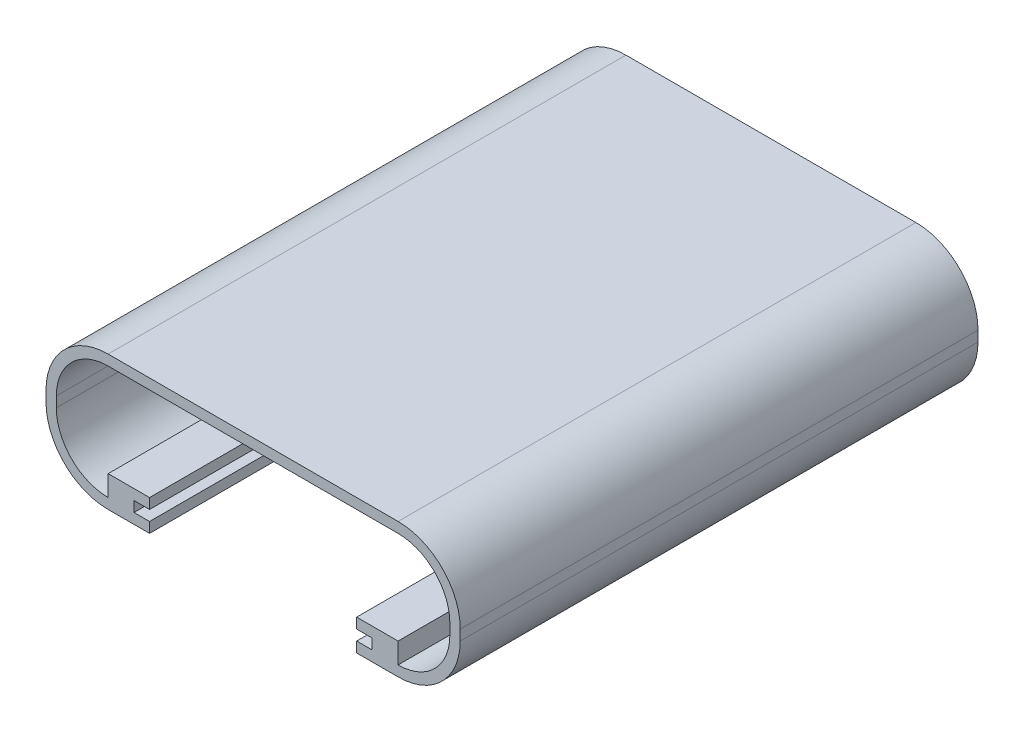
ISO-10303-21;
HEADER;
FILE_DESCRIPTION(('STEP AP214'),'2;1');
FILE_NAME('part.step','',(''),(''),'','','');
FILE_SCHEMA(('AUTOMOTIVE_DESIGN { 1 0 10303 214 1 1 1 1 }'));
ENDSEC;
DATA;
#1=APPLICATION_CONTEXT('core data for automotive mechanical design processes');
#2=APPLICATION_PROTOCOL_DEFINITION('international standard','automotive_design',2000,#1);
#3=PRODUCT_CONTEXT('',#1,'mechanical');
#4=PRODUCT('Part','Part','',(#3));
#5=PRODUCT_RELATED_PRODUCT_CATEGORY('part','',(#4));
#6=PRODUCT_DEFINITION_FORMATION('','',#4);
#7=PRODUCT_DEFINITION_CONTEXT('part definition',#1,'design');
#8=PRODUCT_DEFINITION('design','',#6,#7);
#9=PRODUCT_DEFINITION_SHAPE('','',#8);
#10=(LENGTH_UNIT() NAMED_UNIT(*) SI_UNIT(.MILLI.,.METRE.));
#11=(NAMED_UNIT(*) PLANE_ANGLE_UNIT() SI_UNIT($,.RADIAN.));
#12=(NAMED_UNIT(*) SI_UNIT($,.STERADIAN.) SOLID_ANGLE_UNIT());
#13=UNCERTAINTY_MEASURE_WITH_UNIT(LENGTH_MEASURE(1.E-05),#10,'distance_accuracy_value','');
#14=(GEOMETRIC_REPRESENTATION_CONTEXT(3) GLOBAL_UNCERTAINTY_ASSIGNED_CONTEXT((#13)) GLOBAL_UNIT_ASSIGNED_CONTEXT((#10,
#11,#12)) REPRESENTATION_CONTEXT('',''));
#15=CARTESIAN_POINT('',(0.,0.,0.));
#16=DIRECTION('',(0.,0.,1.));
#17=DIRECTION('',(1.,0.,0.));
#18=AXIS2_PLACEMENT_3D('',#15,#16,#17);
#19=CARTESIAN_POINT('',(-23.8160338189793,5.,50.));
#20=DIRECTION('',(0.,0.,-1.));
#21=DIRECTION('',(-1.,0.,0.));
#22=AXIS2_PLACEMENT_3D('',#19,#20,#21);
#23=CYLINDRICAL_SURFACE('',#22,5.);
#24=CARTESIAN_POINT('',(-23.8160338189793,5.,0.));
#25=DIRECTION('',(0.,0.,-1.));
#26=DIRECTION('',(-1.,0.,0.));
#27=AXIS2_PLACEMENT_3D('',#24,#25,#26);
#28=CIRCLE('',#27,5.);
#29=CARTESIAN_POINT('',(-23.8160338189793,0.,0.));
#30=VERTEX_POINT('',#29);
#31=CARTESIAN_POINT('',(-28.8160338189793,5.,0.));
#32=VERTEX_POINT('',#31);
#33=EDGE_CURVE('E261',#30,#32,#28,.T.);
#34=ORIENTED_EDGE('',*,*,#33,.T.);
#35=DIRECTION('',(0.,0.,-1.));
#36=VECTOR('',#35,1.);
#37=CARTESIAN_POINT('',(-28.8160338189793,5.,50.));
#38=LINE('',#37,#36);
#39=CARTESIAN_POINT('',(-28.8160338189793,5.,50.));
#40=VERTEX_POINT('',#39);
#41=EDGE_CURVE('E11',#40,#32,#38,.T.);
#42=ORIENTED_EDGE('',*,*,#41,.F.);
#43=CARTESIAN_POINT('',(-23.8160338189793,5.,50.));
#44=DIRECTION('',(0.,0.,-1.));
#45=DIRECTION('',(-1.,0.,0.));
#46=AXIS2_PLACEMENT_3D('',#43,#44,#45);
#47=CIRCLE('',#46,5.);
#48=CARTESIAN_POINT('',(-23.8160338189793,0.,50.));
#49=VERTEX_POINT('',#48);
#50=EDGE_CURVE('E319',#49,#40,#47,.T.);
#51=ORIENTED_EDGE('',*,*,#50,.F.);
#52=DIRECTION('',(0.,0.,-1.));
#53=VECTOR('',#52,1.);
#54=CARTESIAN_POINT('',(-23.8160338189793,0.,50.));
#55=LINE('',#54,#53);
#56=EDGE_CURVE('E257',#49,#30,#55,.T.);
#57=ORIENTED_EDGE('',*,*,#56,.T.);
#58=EDGE_LOOP('',(#34,#42,#51,#57));
#59=FACE_BOUND('',#58,.T.);
#60=ADVANCED_FACE('F33',(#59),#23,.F.);
#61=CARTESIAN_POINT('',(-28.8160338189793,5.,50.));
#62=DIRECTION('',(-1.,0.,0.));
#63=DIRECTION('',(0.,0.,1.));
#64=AXIS2_PLACEMENT_3D('',#61,#62,#63);
#65=PLANE('',#64);
#66=DIRECTION('',(0.,1.,0.));
#67=VECTOR('',#66,1.);
#68=CARTESIAN_POINT('',(-28.8160338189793,5.,0.));
#69=LINE('',#68,#67);
#70=CARTESIAN_POINT('',(-28.8160338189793,6.,0.));
#71=VERTEX_POINT('',#70);
#72=EDGE_CURVE('E264',#32,#71,#69,.T.);
#73=ORIENTED_EDGE('',*,*,#72,.T.);
#74=DIRECTION('',(0.,0.,-1.));
#75=VECTOR('',#74,1.);
#76=CARTESIAN_POINT('',(-28.8160338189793,6.,50.));
#77=LINE('',#76,#75);
#78=CARTESIAN_POINT('',(-28.8160338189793,6.,50.));
#79=VERTEX_POINT('',#78);
#80=EDGE_CURVE('E41',#79,#71,#77,.T.);
#81=ORIENTED_EDGE('',*,*,#80,.F.);
#82=DIRECTION('',(0.,1.,0.));
#83=VECTOR('',#82,1.);
#84=CARTESIAN_POINT('',(-28.8160338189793,5.,50.));
#85=LINE('',#84,#83);
#86=EDGE_CURVE('E158',#40,#79,#85,.T.);
#87=ORIENTED_EDGE('',*,*,#86,.F.);
#88=ORIENTED_EDGE('',*,*,#41,.T.);
#89=EDGE_LOOP('',(#73,#81,#87,#88));
#90=FACE_BOUND('',#89,.T.);
#91=ADVANCED_FACE('F487',(#90),#65,.F.);
#92=CARTESIAN_POINT('',(-23.8160338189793,6.,50.));
#93=DIRECTION('',(0.,0.,-1.));
#94=DIRECTION('',(-1.,0.,0.));
#95=AXIS2_PLACEMENT_3D('',#92,#93,#94);
#96=CYLINDRICAL_SURFACE('',#95,5.);
#97=CARTESIAN_POINT('',(-23.8160338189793,6.,0.));
#98=DIRECTION('',(0.,0.,-1.));
#99=DIRECTION('',(-1.,0.,0.));
#100=AXIS2_PLACEMENT_3D('',#97,#98,#99);
#101=CIRCLE('',#100,5.);
#102=CARTESIAN_POINT('',(-23.8160338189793,11.,0.));
#103=VERTEX_POINT('',#102);
#104=EDGE_CURVE('E266',#71,#103,#101,.T.);
#105=ORIENTED_EDGE('',*,*,#104,.T.);
#106=DIRECTION('',(0.,0.,-1.));
#107=VECTOR('',#106,1.);
#108=CARTESIAN_POINT('',(-23.8160338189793,11.,50.));
#109=LINE('',#108,#107);
#110=CARTESIAN_POINT('',(-23.8160338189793,11.,50.));
#111=VERTEX_POINT('',#110);
#112=EDGE_CURVE('E392',#111,#103,#109,.T.);
#113=ORIENTED_EDGE('',*,*,#112,.F.);
#114=CARTESIAN_POINT('',(-23.8160338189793,6.,50.));
#115=DIRECTION('',(0.,0.,-1.));
#116=DIRECTION('',(-1.,0.,0.));
#117=AXIS2_PLACEMENT_3D('',#114,#115,#116);
#118=CIRCLE('',#117,5.);
#119=EDGE_CURVE('E400',#79,#111,#118,.T.);
#120=ORIENTED_EDGE('',*,*,#119,.F.);
#121=ORIENTED_EDGE('',*,*,#80,.T.);
#122=EDGE_LOOP('',(#105,#113,#120,#121));
#123=FACE_BOUND('',#122,.T.);
#124=ADVANCED_FACE('F398',(#123),#96,.F.);
#125=CARTESIAN_POINT('',(-23.8160338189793,11.,50.));
#126=DIRECTION('',(0.,1.,0.));
#127=DIRECTION('',(-1.,0.,0.));
#128=AXIS2_PLACEMENT_3D('',#125,#126,#127);
#129=PLANE('',#128);
#130=DIRECTION('',(1.,0.,0.));
#131=VECTOR('',#130,1.);
#132=CARTESIAN_POINT('',(-23.8160338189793,11.,0.));
#133=LINE('',#132,#131);
#134=CARTESIAN_POINT('',(4.18396618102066,11.,0.));
#135=VERTEX_POINT('',#134);
#136=EDGE_CURVE('E268',#103,#135,#133,.T.);
#137=ORIENTED_EDGE('',*,*,#136,.T.);
#138=DIRECTION('',(0.,0.,-1.));
#139=VECTOR('',#138,1.);
#140=CARTESIAN_POINT('',(4.18396618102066,11.,50.));
#141=LINE('',#140,#139);
#142=CARTESIAN_POINT('',(4.18396618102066,11.,50.));
#143=VERTEX_POINT('',#142);
#144=EDGE_CURVE('E389',#143,#135,#141,.T.);
#145=ORIENTED_EDGE('',*,*,#144,.F.);
#146=DIRECTION('',(1.,0.,0.));
#147=VECTOR('',#146,1.);
#148=CARTESIAN_POINT('',(-23.8160338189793,11.,50.));
#149=LINE('',#148,#147);
#150=EDGE_CURVE('E418',#111,#143,#149,.T.);
#151=ORIENTED_EDGE('',*,*,#150,.F.);
#152=ORIENTED_EDGE('',*,*,#112,.T.);
#153=EDGE_LOOP('',(#137,#145,#151,#152));
#154=FACE_BOUND('',#153,.T.);
#155=ADVANCED_FACE('F409',(#154),#129,.F.);
#156=CARTESIAN_POINT('',(4.18396618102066,6.,50.));
#157=DIRECTION('',(0.,0.,-1.));
#158=DIRECTION('',(-1.,0.,0.));
#159=AXIS2_PLACEMENT_3D('',#156,#157,#158);
#160=CYLINDRICAL_SURFACE('',#159,5.);
#161=CARTESIAN_POINT('',(4.18396618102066,6.,0.));
#162=DIRECTION('',(0.,0.,-1.));
#163=DIRECTION('',(1.,0.,0.));
#164=AXIS2_PLACEMENT_3D('',#161,#162,#163);
#165=CIRCLE('',#164,5.);
#166=CARTESIAN_POINT('',(9.18396618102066,6.,0.));
#167=VERTEX_POINT('',#166);
#168=EDGE_CURVE('E270',#135,#167,#165,.T.);
#169=ORIENTED_EDGE('',*,*,#168,.T.);
#170=DIRECTION('',(0.,0.,-1.));
#171=VECTOR('',#170,1.);
#172=CARTESIAN_POINT('',(9.18396618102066,6.,50.));
#173=LINE('',#172,#171);
#174=CARTESIAN_POINT('',(9.18396618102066,6.,50.));
#175=VERTEX_POINT('',#174);
#176=EDGE_CURVE('E386',#175,#167,#173,.T.);
#177=ORIENTED_EDGE('',*,*,#176,.F.);
#178=CARTESIAN_POINT('',(4.18396618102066,6.,50.));
#179=DIRECTION('',(0.,0.,-1.));
#180=DIRECTION('',(1.,0.,0.));
#181=AXIS2_PLACEMENT_3D('',#178,#179,#180);
#182=CIRCLE('',#181,5.);
#183=EDGE_CURVE('E415',#143,#175,#182,.T.);
#184=ORIENTED_EDGE('',*,*,#183,.F.);
#185=ORIENTED_EDGE('',*,*,#144,.T.);
#186=EDGE_LOOP('',(#169,#177,#184,#185));
#187=FACE_BOUND('',#186,.T.);
#188=ADVANCED_FACE('F413',(#187),#160,.F.);
#189=CARTESIAN_POINT('',(9.18396618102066,5.,50.));
#190=DIRECTION('',(1.,0.,0.));
#191=DIRECTION('',(0.,0.,-1.));
#192=AXIS2_PLACEMENT_3D('',#189,#190,#191);
#193=PLANE('',#192);
#194=DIRECTION('',(0.,-1.,0.));
#195=VECTOR('',#194,1.);
#196=CARTESIAN_POINT('',(9.18396618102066,5.,0.));
#197=LINE('',#196,#195);
#198=CARTESIAN_POINT('',(9.18396618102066,5.,0.));
#199=VERTEX_POINT('',#198);
#200=EDGE_CURVE('E272',#167,#199,#197,.T.);
#201=ORIENTED_EDGE('',*,*,#200,.T.);
#202=DIRECTION('',(0.,0.,-1.));
#203=VECTOR('',#202,1.);
#204=CARTESIAN_POINT('',(9.18396618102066,5.,50.));
#205=LINE('',#204,#203);
#206=CARTESIAN_POINT('',(9.18396618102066,5.,50.));
#207=VERTEX_POINT('',#206);
#208=EDGE_CURVE('E383',#207,#199,#205,.T.);
#209=ORIENTED_EDGE('',*,*,#208,.F.);
#210=DIRECTION('',(0.,-1.,0.));
#211=VECTOR('',#210,1.);
#212=CARTESIAN_POINT('',(9.18396618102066,5.,50.));
#213=LINE('',#212,#211);
#214=EDGE_CURVE('E417',#175,#207,#213,.T.);
#215=ORIENTED_EDGE('',*,*,#214,.F.);
#216=ORIENTED_EDGE('',*,*,#176,.T.);
#217=EDGE_LOOP('',(#201,#209,#215,#216));
#218=FACE_BOUND('',#217,.T.);
#219=ADVANCED_FACE('F500',(#218),#193,.F.);
#220=CARTESIAN_POINT('',(4.18396618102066,5.,50.));
#221=DIRECTION('',(0.,0.,-1.));
#222=DIRECTION('',(-1.,0.,0.));
#223=AXIS2_PLACEMENT_3D('',#220,#221,#222);
#224=CYLINDRICAL_SURFACE('',#223,5.);
#225=CARTESIAN_POINT('',(4.18396618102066,5.,0.));
#226=DIRECTION('',(0.,0.,-1.));
#227=DIRECTION('',(1.,0.,0.));
#228=AXIS2_PLACEMENT_3D('',#225,#226,#227);
#229=CIRCLE('',#228,5.);
#230=CARTESIAN_POINT('',(4.18396618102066,0.,0.));
#231=VERTEX_POINT('',#230);
#232=EDGE_CURVE('E274',#199,#231,#229,.T.);
#233=ORIENTED_EDGE('',*,*,#232,.T.);
#234=DIRECTION('',(0.,0.,-1.));
#235=VECTOR('',#234,1.);
#236=CARTESIAN_POINT('',(4.18396618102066,0.,50.));
#237=LINE('',#236,#235);
#238=CARTESIAN_POINT('',(4.18396618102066,0.,50.));
#239=VERTEX_POINT('',#238);
#240=EDGE_CURVE('E380',#239,#231,#237,.T.);
#241=ORIENTED_EDGE('',*,*,#240,.F.);
#242=CARTESIAN_POINT('',(4.18396618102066,5.,50.));
#243=DIRECTION('',(0.,0.,-1.));
#244=DIRECTION('',(1.,0.,0.));
#245=AXIS2_PLACEMENT_3D('',#242,#243,#244);
#246=CIRCLE('',#245,5.);
#247=EDGE_CURVE('E420',#207,#239,#246,.T.);
#248=ORIENTED_EDGE('',*,*,#247,.F.);
#249=ORIENTED_EDGE('',*,*,#208,.T.);
#250=EDGE_LOOP('',(#233,#241,#248,#249));
#251=FACE_BOUND('',#250,.T.);
#252=ADVANCED_FACE('F503',(#251),#224,.F.);
#253=CARTESIAN_POINT('',(4.18396618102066,0.,50.));
#254=DIRECTION('',(-1.,0.,0.));
#255=DIRECTION('',(0.,0.,1.));
#256=AXIS2_PLACEMENT_3D('',#253,#254,#255);
#257=PLANE('',#256);
#258=DIRECTION('',(0.,1.,0.));
#259=VECTOR('',#258,1.);
#260=CARTESIAN_POINT('',(4.18396618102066,0.,0.));
#261=LINE('',#260,#259);
#262=CARTESIAN_POINT('',(4.18396618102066,2.,0.));
#263=VERTEX_POINT('',#262);
#264=EDGE_CURVE('E276',#231,#263,#261,.T.);
#265=ORIENTED_EDGE('',*,*,#264,.T.);
#266=DIRECTION('',(0.,0.,-1.));
#267=VECTOR('',#266,1.);
#268=CARTESIAN_POINT('',(4.18396618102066,2.,50.));
#269=LINE('',#268,#267);
#270=CARTESIAN_POINT('',(4.18396618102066,2.,50.));
#271=VERTEX_POINT('',#270);
#272=EDGE_CURVE('E377',#271,#263,#269,.T.);
#273=ORIENTED_EDGE('',*,*,#272,.F.);
#274=DIRECTION('',(0.,1.,0.));
#275=VECTOR('',#274,1.);
#276=CARTESIAN_POINT('',(4.18396618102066,0.,50.));
#277=LINE('',#276,#275);
#278=EDGE_CURVE('E426',#239,#271,#277,.T.);
#279=ORIENTED_EDGE('',*,*,#278,.F.);
#280=ORIENTED_EDGE('',*,*,#240,.T.);
#281=EDGE_LOOP('',(#265,#273,#279,#280));
#282=FACE_BOUND('',#281,.T.);
#283=ADVANCED_FACE('F507',(#282),#257,.F.);
#284=CARTESIAN_POINT('',(4.18396618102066,2.,50.));
#285=DIRECTION('',(0.,-1.,0.));
#286=DIRECTION('',(0.,0.,-1.));
#287=AXIS2_PLACEMENT_3D('',#284,#285,#286);
#288=PLANE('',#287);
#289=DIRECTION('',(-1.,0.,0.));
#290=VECTOR('',#289,1.);
#291=CARTESIAN_POINT('',(4.18396618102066,2.,0.));
#292=LINE('',#291,#290);
#293=CARTESIAN_POINT('',(0.183966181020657,2.,0.));
#294=VERTEX_POINT('',#293);
#295=EDGE_CURVE('E278',#263,#294,#292,.T.);
#296=ORIENTED_EDGE('',*,*,#295,.T.);
#297=DIRECTION('',(0.,0.,-1.));
#298=VECTOR('',#297,1.);
#299=CARTESIAN_POINT('',(0.183966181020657,2.,50.));
#300=LINE('',#299,#298);
#301=CARTESIAN_POINT('',(0.183966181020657,2.,50.));
#302=VERTEX_POINT('',#301);
#303=EDGE_CURVE('E374',#302,#294,#300,.T.);
#304=ORIENTED_EDGE('',*,*,#303,.F.);
#305=DIRECTION('',(-1.,0.,0.));
#306=VECTOR('',#305,1.);
#307=CARTESIAN_POINT('',(4.18396618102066,2.,50.));
#308=LINE('',#307,#306);
#309=EDGE_CURVE('E428',#271,#302,#308,.T.);
#310=ORIENTED_EDGE('',*,*,#309,.F.);
#311=ORIENTED_EDGE('',*,*,#272,.T.);
#312=EDGE_LOOP('',(#296,#304,#310,#311));
#313=FACE_BOUND('',#312,.T.);
#314=ADVANCED_FACE('F511',(#313),#288,.F.);
#315=CARTESIAN_POINT('',(0.183966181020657,2.,50.));
#316=DIRECTION('',(1.,0.,0.));
#317=DIRECTION('',(0.,0.,-1.));
#318=AXIS2_PLACEMENT_3D('',#315,#316,#317);
#319=PLANE('',#318);
#320=DIRECTION('',(0.,-1.,0.));
#321=VECTOR('',#320,1.);
#322=CARTESIAN_POINT('',(0.183966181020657,2.,0.));
#323=LINE('',#322,#321);
#324=CARTESIAN_POINT('',(0.183966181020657,1.,0.));
#325=VERTEX_POINT('',#324);
#326=EDGE_CURVE('E280',#294,#325,#323,.T.);
#327=ORIENTED_EDGE('',*,*,#326,.T.);
#328=DIRECTION('',(0.,0.,-1.));
#329=VECTOR('',#328,1.);
#330=CARTESIAN_POINT('',(0.183966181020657,1.,50.));
#331=LINE('',#330,#329);
#332=CARTESIAN_POINT('',(0.183966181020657,1.,50.));
#333=VERTEX_POINT('',#332);
#334=EDGE_CURVE('E371',#333,#325,#331,.T.);
#335=ORIENTED_EDGE('',*,*,#334,.F.);
#336=DIRECTION('',(0.,-1.,0.));
#337=VECTOR('',#336,1.);
#338=CARTESIAN_POINT('',(0.183966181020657,2.,50.));
#339=LINE('',#338,#337);
#340=EDGE_CURVE('E430',#302,#333,#339,.T.);
#341=ORIENTED_EDGE('',*,*,#340,.F.);
#342=ORIENTED_EDGE('',*,*,#303,.T.);
#343=EDGE_LOOP('',(#327,#335,#341,#342));
#344=FACE_BOUND('',#343,.T.);
#345=ADVANCED_FACE('F515',(#344),#319,.F.);
#346=CARTESIAN_POINT('',(0.183966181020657,1.,50.));
#347=DIRECTION('',(0.,1.,0.));
#348=DIRECTION('',(0.,0.,1.));
#349=AXIS2_PLACEMENT_3D('',#346,#347,#348);
#350=PLANE('',#349);
#351=DIRECTION('',(1.,0.,0.));
#352=VECTOR('',#351,1.);
#353=CARTESIAN_POINT('',(0.183966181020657,1.,0.));
#354=LINE('',#353,#352);
#355=CARTESIAN_POINT('',(1.68396618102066,1.,0.));
#356=VERTEX_POINT('',#355);
#357=EDGE_CURVE('E282',#325,#356,#354,.T.);
#358=ORIENTED_EDGE('',*,*,#357,.T.);
#359=DIRECTION('',(0.,0.,-1.));
#360=VECTOR('',#359,1.);
#361=CARTESIAN_POINT('',(1.68396618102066,1.,50.));
#362=LINE('',#361,#360);
#363=CARTESIAN_POINT('',(1.68396618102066,1.,50.));
#364=VERTEX_POINT('',#363);
#365=EDGE_CURVE('E368',#364,#356,#362,.T.);
#366=ORIENTED_EDGE('',*,*,#365,.F.);
#367=DIRECTION('',(1.,0.,0.));
#368=VECTOR('',#367,1.);
#369=CARTESIAN_POINT('',(0.183966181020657,1.,50.));
#370=LINE('',#369,#368);
#371=EDGE_CURVE('E432',#333,#364,#370,.T.);
#372=ORIENTED_EDGE('',*,*,#371,.F.);
#373=ORIENTED_EDGE('',*,*,#334,.T.);
#374=EDGE_LOOP('',(#358,#366,#372,#373));
#375=FACE_BOUND('',#374,.T.);
#376=ADVANCED_FACE('F519',(#375),#350,.F.);
#377=CARTESIAN_POINT('',(1.68396618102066,1.,50.));
#378=DIRECTION('',(1.,0.,0.));
#379=DIRECTION('',(0.,1.,0.));
#380=AXIS2_PLACEMENT_3D('',#377,#378,#379);
#381=PLANE('',#380);
#382=DIRECTION('',(0.,-1.,0.));
#383=VECTOR('',#382,1.);
#384=CARTESIAN_POINT('',(1.68396618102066,1.,0.));
#385=LINE('',#384,#383);
#386=CARTESIAN_POINT('',(1.68396618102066,0.,0.));
#387=VERTEX_POINT('',#386);
#388=EDGE_CURVE('E284',#356,#387,#385,.T.);
#389=ORIENTED_EDGE('',*,*,#388,.T.);
#390=DIRECTION('',(0.,0.,-1.));
#391=VECTOR('',#390,1.);
#392=CARTESIAN_POINT('',(1.68396618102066,0.,50.));
#393=LINE('',#392,#391);
#394=CARTESIAN_POINT('',(1.68396618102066,0.,50.));
#395=VERTEX_POINT('',#394);
#396=EDGE_CURVE('E365',#395,#387,#393,.T.);
#397=ORIENTED_EDGE('',*,*,#396,.F.);
#398=DIRECTION('',(0.,-1.,0.));
#399=VECTOR('',#398,1.);
#400=CARTESIAN_POINT('',(1.68396618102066,1.,50.));
#401=LINE('',#400,#399);
#402=EDGE_CURVE('E434',#364,#395,#401,.T.);
#403=ORIENTED_EDGE('',*,*,#402,.F.);
#404=ORIENTED_EDGE('',*,*,#365,.T.);
#405=EDGE_LOOP('',(#389,#397,#403,#404));
#406=FACE_BOUND('',#405,.T.);
#407=ADVANCED_FACE('F523',(#406),#381,.F.);
#408=CARTESIAN_POINT('',(1.68396618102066,0.,50.));
#409=DIRECTION('',(0.,-1.,0.));
#410=DIRECTION('',(1.,0.,0.));
#411=AXIS2_PLACEMENT_3D('',#408,#409,#410);
#412=PLANE('',#411);
#413=DIRECTION('',(-1.,0.,0.));
#414=VECTOR('',#413,1.);
#415=CARTESIAN_POINT('',(1.68396618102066,0.,0.));
#416=LINE('',#415,#414);
#417=CARTESIAN_POINT('',(0.183966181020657,0.,0.));
#418=VERTEX_POINT('',#417);
#419=EDGE_CURVE('E286',#387,#418,#416,.T.);
#420=ORIENTED_EDGE('',*,*,#419,.T.);
#421=DIRECTION('',(0.,0.,-1.));
#422=VECTOR('',#421,1.);
#423=CARTESIAN_POINT('',(0.183966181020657,0.,50.));
#424=LINE('',#423,#422);
#425=CARTESIAN_POINT('',(0.183966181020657,0.,50.));
#426=VERTEX_POINT('',#425);
#427=EDGE_CURVE('E362',#426,#418,#424,.T.);
#428=ORIENTED_EDGE('',*,*,#427,.F.);
#429=DIRECTION('',(-1.,0.,0.));
#430=VECTOR('',#429,1.);
#431=CARTESIAN_POINT('',(1.68396618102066,0.,50.));
#432=LINE('',#431,#430);
#433=EDGE_CURVE('E436',#395,#426,#432,.T.);
#434=ORIENTED_EDGE('',*,*,#433,.F.);
#435=ORIENTED_EDGE('',*,*,#396,.T.);
#436=EDGE_LOOP('',(#420,#428,#434,#435));
#437=FACE_BOUND('',#436,.T.);
#438=ADVANCED_FACE('F527',(#437),#412,.F.);
#439=CARTESIAN_POINT('',(0.183966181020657,0.,50.));
#440=DIRECTION('',(1.,0.,0.));
#441=DIRECTION('',(0.,0.,-1.));
#442=AXIS2_PLACEMENT_3D('',#439,#440,#441);
#443=PLANE('',#442);
#444=DIRECTION('',(0.,-1.,0.));
#445=VECTOR('',#444,1.);
#446=CARTESIAN_POINT('',(0.183966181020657,0.,0.));
#447=LINE('',#446,#445);
#448=CARTESIAN_POINT('',(0.183966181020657,-1.,0.));
#449=VERTEX_POINT('',#448);
#450=EDGE_CURVE('E288',#418,#449,#447,.T.);
#451=ORIENTED_EDGE('',*,*,#450,.T.);
#452=DIRECTION('',(0.,0.,-1.));
#453=VECTOR('',#452,1.);
#454=CARTESIAN_POINT('',(0.183966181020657,-1.,50.));
#455=LINE('',#454,#453);
#456=CARTESIAN_POINT('',(0.183966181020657,-1.,50.));
#457=VERTEX_POINT('',#456);
#458=EDGE_CURVE('E359',#457,#449,#455,.T.);
#459=ORIENTED_EDGE('',*,*,#458,.F.);
#460=DIRECTION('',(0.,-1.,0.));
#461=VECTOR('',#460,1.);
#462=CARTESIAN_POINT('',(0.183966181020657,0.,50.));
#463=LINE('',#462,#461);
#464=EDGE_CURVE('E438',#426,#457,#463,.T.);
#465=ORIENTED_EDGE('',*,*,#464,.F.);
#466=ORIENTED_EDGE('',*,*,#427,.T.);
#467=EDGE_LOOP('',(#451,#459,#465,#466));
#468=FACE_BOUND('',#467,.T.);
#469=ADVANCED_FACE('F531',(#468),#443,.F.);
#470=CARTESIAN_POINT('',(0.183966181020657,-1.,50.));
#471=DIRECTION('',(0.,1.,0.));
#472=DIRECTION('',(0.,0.,1.));
#473=AXIS2_PLACEMENT_3D('',#470,#471,#472);
#474=PLANE('',#473);
#475=DIRECTION('',(1.,0.,0.));
#476=VECTOR('',#475,1.);
#477=CARTESIAN_POINT('',(0.183966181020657,-1.,0.));
#478=LINE('',#477,#476);
#479=CARTESIAN_POINT('',(4.18396618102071,-1.,0.));
#480=VERTEX_POINT('',#479);
#481=EDGE_CURVE('E290',#449,#480,#478,.T.);
#482=ORIENTED_EDGE('',*,*,#481,.T.);
#483=DIRECTION('',(0.,0.,-1.));
#484=VECTOR('',#483,1.);
#485=CARTESIAN_POINT('',(4.18396618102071,-1.,50.));
#486=LINE('',#485,#484);
#487=CARTESIAN_POINT('',(4.18396618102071,-1.,50.));
#488=VERTEX_POINT('',#487);
#489=EDGE_CURVE('E356',#488,#480,#486,.T.);
#490=ORIENTED_EDGE('',*,*,#489,.F.);
#491=DIRECTION('',(1.,0.,0.));
#492=VECTOR('',#491,1.);
#493=CARTESIAN_POINT('',(0.183966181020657,-1.,50.));
#494=LINE('',#493,#492);
#495=EDGE_CURVE('E440',#457,#488,#494,.T.);
#496=ORIENTED_EDGE('',*,*,#495,.F.);
#497=ORIENTED_EDGE('',*,*,#458,.T.);
#498=EDGE_LOOP('',(#482,#490,#496,#497));
#499=FACE_BOUND('',#498,.T.);
#500=ADVANCED_FACE('F535',(#499),#474,.F.);
#501=CARTESIAN_POINT('',(4.18396618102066,5.,50.));
#502=DIRECTION('',(0.,0.,-1.));
#503=DIRECTION('',(-1.,0.,0.));
#504=AXIS2_PLACEMENT_3D('',#501,#502,#503);
#505=CYLINDRICAL_SURFACE('',#504,6.);
#506=CARTESIAN_POINT('',(4.18396618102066,5.,0.));
#507=DIRECTION('',(0.,0.,1.));
#508=DIRECTION('',(1.,0.,0.));
#509=AXIS2_PLACEMENT_3D('',#506,#507,#508);
#510=CIRCLE('',#509,6.);
#511=CARTESIAN_POINT('',(10.1839661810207,5.00000000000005,0.));
#512=VERTEX_POINT('',#511);
#513=EDGE_CURVE('E292',#480,#512,#510,.T.);
#514=ORIENTED_EDGE('',*,*,#513,.T.);
#515=DIRECTION('',(0.,0.,-1.));
#516=VECTOR('',#515,1.);
#517=CARTESIAN_POINT('',(10.1839661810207,5.00000000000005,50.));
#518=LINE('',#517,#516);
#519=CARTESIAN_POINT('',(10.1839661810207,5.00000000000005,50.));
#520=VERTEX_POINT('',#519);
#521=EDGE_CURVE('E353',#520,#512,#518,.T.);
#522=ORIENTED_EDGE('',*,*,#521,.F.);
#523=CARTESIAN_POINT('',(4.18396618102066,5.,50.));
#524=DIRECTION('',(0.,0.,1.));
#525=DIRECTION('',(1.,0.,0.));
#526=AXIS2_PLACEMENT_3D('',#523,#524,#525);
#527=CIRCLE('',#526,6.);
#528=EDGE_CURVE('E442',#488,#520,#527,.T.);
#529=ORIENTED_EDGE('',*,*,#528,.F.);
#530=ORIENTED_EDGE('',*,*,#489,.T.);
#531=EDGE_LOOP('',(#514,#522,#529,#530));
#532=FACE_BOUND('',#531,.T.);
#533=ADVANCED_FACE('F539',(#532),#505,.T.);
#534=CARTESIAN_POINT('',(10.1839661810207,5.00000000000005,50.));
#535=DIRECTION('',(-1.,0.,0.));
#536=DIRECTION('',(0.,0.,1.));
#537=AXIS2_PLACEMENT_3D('',#534,#535,#536);
#538=PLANE('',#537);
#539=DIRECTION('',(0.,1.,0.));
#540=VECTOR('',#539,1.);
#541=CARTESIAN_POINT('',(10.1839661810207,5.00000000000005,0.));
#542=LINE('',#541,#540);
#543=CARTESIAN_POINT('',(10.1839661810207,6.,0.));
#544=VERTEX_POINT('',#543);
#545=EDGE_CURVE('E294',#512,#544,#542,.T.);
#546=ORIENTED_EDGE('',*,*,#545,.T.);
#547=DIRECTION('',(0.,0.,-1.));
#548=VECTOR('',#547,1.);
#549=CARTESIAN_POINT('',(10.1839661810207,6.,50.));
#550=LINE('',#549,#548);
#551=CARTESIAN_POINT('',(10.1839661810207,6.,50.));
#552=VERTEX_POINT('',#551);
#553=EDGE_CURVE('E350',#552,#544,#550,.T.);
#554=ORIENTED_EDGE('',*,*,#553,.F.);
#555=DIRECTION('',(0.,1.,0.));
#556=VECTOR('',#555,1.);
#557=CARTESIAN_POINT('',(10.1839661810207,5.00000000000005,50.));
#558=LINE('',#557,#556);
#559=EDGE_CURVE('E444',#520,#552,#558,.T.);
#560=ORIENTED_EDGE('',*,*,#559,.F.);
#561=ORIENTED_EDGE('',*,*,#521,.T.);
#562=EDGE_LOOP('',(#546,#554,#560,#561));
#563=FACE_BOUND('',#562,.T.);
#564=ADVANCED_FACE('F543',(#563),#538,.F.);
#565=CARTESIAN_POINT('',(4.18396618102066,6.,50.));
#566=DIRECTION('',(0.,0.,-1.));
#567=DIRECTION('',(-1.,0.,0.));
#568=AXIS2_PLACEMENT_3D('',#565,#566,#567);
#569=CYLINDRICAL_SURFACE('',#568,6.);
#570=CARTESIAN_POINT('',(4.18396618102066,6.,0.));
#571=DIRECTION('',(0.,0.,1.));
#572=DIRECTION('',(1.,0.,0.));
#573=AXIS2_PLACEMENT_3D('',#570,#571,#572);
#574=CIRCLE('',#573,6.);
#575=CARTESIAN_POINT('',(4.18396618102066,12.,0.));
#576=VERTEX_POINT('',#575);
#577=EDGE_CURVE('E296',#544,#576,#574,.T.);
#578=ORIENTED_EDGE('',*,*,#577,.T.);
#579=DIRECTION('',(0.,0.,-1.));
#580=VECTOR('',#579,1.);
#581=CARTESIAN_POINT('',(4.18396618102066,12.,50.));
#582=LINE('',#581,#580);
#583=CARTESIAN_POINT('',(4.18396618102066,12.,50.));
#584=VERTEX_POINT('',#583);
#585=EDGE_CURVE('E347',#584,#576,#582,.T.);
#586=ORIENTED_EDGE('',*,*,#585,.F.);
#587=CARTESIAN_POINT('',(4.18396618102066,6.,50.));
#588=DIRECTION('',(0.,0.,1.));
#589=DIRECTION('',(1.,0.,0.));
#590=AXIS2_PLACEMENT_3D('',#587,#588,#589);
#591=CIRCLE('',#590,6.);
#592=EDGE_CURVE('E446',#552,#584,#591,.T.);
#593=ORIENTED_EDGE('',*,*,#592,.F.);
#594=ORIENTED_EDGE('',*,*,#553,.T.);
#595=EDGE_LOOP('',(#578,#586,#593,#594));
#596=FACE_BOUND('',#595,.T.);
#597=ADVANCED_FACE('F547',(#596),#569,.T.);
#598=CARTESIAN_POINT('',(-23.8160338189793,12.,50.));
#599=DIRECTION('',(0.,-1.,0.));
#600=DIRECTION('',(1.,0.,0.));
#601=AXIS2_PLACEMENT_3D('',#598,#599,#600);
#602=PLANE('',#601);
#603=DIRECTION('',(-1.,0.,0.));
#604=VECTOR('',#603,1.);
#605=CARTESIAN_POINT('',(-23.8160338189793,12.,0.));
#606=LINE('',#605,#604);
#607=CARTESIAN_POINT('',(-23.8160338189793,12.,0.));
#608=VERTEX_POINT('',#607);
#609=EDGE_CURVE('E298',#576,#608,#606,.T.);
#610=ORIENTED_EDGE('',*,*,#609,.T.);
#611=DIRECTION('',(0.,0.,-1.));
#612=VECTOR('',#611,1.);
#613=CARTESIAN_POINT('',(-23.8160338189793,12.,50.));
#614=LINE('',#613,#612);
#615=CARTESIAN_POINT('',(-23.8160338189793,12.,50.));
#616=VERTEX_POINT('',#615);
#617=EDGE_CURVE('E344',#616,#608,#614,.T.);
#618=ORIENTED_EDGE('',*,*,#617,.F.);
#619=DIRECTION('',(-1.,0.,0.));
#620=VECTOR('',#619,1.);
#621=CARTESIAN_POINT('',(-23.8160338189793,12.,50.));
#622=LINE('',#621,#620);
#623=EDGE_CURVE('E448',#584,#616,#622,.T.);
#624=ORIENTED_EDGE('',*,*,#623,.F.);
#625=ORIENTED_EDGE('',*,*,#585,.T.);
#626=EDGE_LOOP('',(#610,#618,#624,#625));
#627=FACE_BOUND('',#626,.T.);
#628=ADVANCED_FACE('F551',(#627),#602,.F.);
#629=CARTESIAN_POINT('',(-23.8160338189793,6.,50.));
#630=DIRECTION('',(0.,0.,-1.));
#631=DIRECTION('',(-1.,0.,0.));
#632=AXIS2_PLACEMENT_3D('',#629,#630,#631);
#633=CYLINDRICAL_SURFACE('',#632,6.);
#634=CARTESIAN_POINT('',(-23.8160338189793,6.,0.));
#635=DIRECTION('',(0.,0.,1.));
#636=DIRECTION('',(-1.,0.,0.));
#637=AXIS2_PLACEMENT_3D('',#634,#635,#636);
#638=CIRCLE('',#637,6.);
#639=CARTESIAN_POINT('',(-29.8160338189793,6.,0.));
#640=VERTEX_POINT('',#639);
#641=EDGE_CURVE('E300',#608,#640,#638,.T.);
#642=ORIENTED_EDGE('',*,*,#641,.T.);
#643=DIRECTION('',(0.,0.,-1.));
#644=VECTOR('',#643,1.);
#645=CARTESIAN_POINT('',(-29.8160338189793,6.,50.));
#646=LINE('',#645,#644);
#647=CARTESIAN_POINT('',(-29.8160338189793,6.,50.));
#648=VERTEX_POINT('',#647);
#649=EDGE_CURVE('E341',#648,#640,#646,.T.);
#650=ORIENTED_EDGE('',*,*,#649,.F.);
#651=CARTESIAN_POINT('',(-23.8160338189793,6.,50.));
#652=DIRECTION('',(0.,0.,1.));
#653=DIRECTION('',(-1.,0.,0.));
#654=AXIS2_PLACEMENT_3D('',#651,#652,#653);
#655=CIRCLE('',#654,6.);
#656=EDGE_CURVE('E450',#616,#648,#655,.T.);
#657=ORIENTED_EDGE('',*,*,#656,.F.);
#658=ORIENTED_EDGE('',*,*,#617,.T.);
#659=EDGE_LOOP('',(#642,#650,#657,#658));
#660=FACE_BOUND('',#659,.T.);
#661=ADVANCED_FACE('F555',(#660),#633,.T.);
#662=CARTESIAN_POINT('',(-29.8160338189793,5.00000000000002,50.));
#663=DIRECTION('',(1.,0.,0.));
#664=DIRECTION('',(0.,0.,-1.));
#665=AXIS2_PLACEMENT_3D('',#662,#663,#664);
#666=PLANE('',#665);
#667=DIRECTION('',(0.,-1.,0.));
#668=VECTOR('',#667,1.);
#669=CARTESIAN_POINT('',(-29.8160338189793,5.00000000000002,0.));
#670=LINE('',#669,#668);
#671=CARTESIAN_POINT('',(-29.8160338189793,5.,0.));
#672=VERTEX_POINT('',#671);
#673=EDGE_CURVE('E302',#640,#672,#670,.T.);
#674=ORIENTED_EDGE('',*,*,#673,.T.);
#675=DIRECTION('',(0.,0.,-1.));
#676=VECTOR('',#675,1.);
#677=CARTESIAN_POINT('',(-29.8160338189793,5.,50.));
#678=LINE('',#677,#676);
#679=CARTESIAN_POINT('',(-29.8160338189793,5.,50.));
#680=VERTEX_POINT('',#679);
#681=EDGE_CURVE('E338',#680,#672,#678,.T.);
#682=ORIENTED_EDGE('',*,*,#681,.F.);
#683=DIRECTION('',(0.,-1.,0.));
#684=VECTOR('',#683,1.);
#685=CARTESIAN_POINT('',(-29.8160338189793,5.00000000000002,50.));
#686=LINE('',#685,#684);
#687=EDGE_CURVE('E452',#648,#680,#686,.T.);
#688=ORIENTED_EDGE('',*,*,#687,.F.);
#689=ORIENTED_EDGE('',*,*,#649,.T.);
#690=EDGE_LOOP('',(#674,#682,#688,#689));
#691=FACE_BOUND('',#690,.T.);
#692=ADVANCED_FACE('F559',(#691),#666,.F.);
#693=CARTESIAN_POINT('',(-23.8160338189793,5.,50.));
#694=DIRECTION('',(0.,0.,-1.));
#695=DIRECTION('',(-1.,0.,0.));
#696=AXIS2_PLACEMENT_3D('',#693,#694,#695);
#697=CYLINDRICAL_SURFACE('',#696,6.);
#698=CARTESIAN_POINT('',(-23.8160338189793,5.,0.));
#699=DIRECTION('',(0.,0.,1.));
#700=DIRECTION('',(-1.,0.,0.));
#701=AXIS2_PLACEMENT_3D('',#698,#699,#700);
#702=CIRCLE('',#701,6.);
#703=CARTESIAN_POINT('',(-23.8160338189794,-1.,0.));
#704=VERTEX_POINT('',#703);
#705=EDGE_CURVE('E304',#672,#704,#702,.T.);
#706=ORIENTED_EDGE('',*,*,#705,.T.);
#707=DIRECTION('',(0.,0.,-1.));
#708=VECTOR('',#707,1.);
#709=CARTESIAN_POINT('',(-23.8160338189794,-1.,50.));
#710=LINE('',#709,#708);
#711=CARTESIAN_POINT('',(-23.8160338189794,-1.,50.));
#712=VERTEX_POINT('',#711);
#713=EDGE_CURVE('E335',#712,#704,#710,.T.);
#714=ORIENTED_EDGE('',*,*,#713,.F.);
#715=CARTESIAN_POINT('',(-23.8160338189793,5.,50.));
#716=DIRECTION('',(0.,0.,1.));
#717=DIRECTION('',(-1.,0.,0.));
#718=AXIS2_PLACEMENT_3D('',#715,#716,#717);
#719=CIRCLE('',#718,6.);
#720=EDGE_CURVE('E454',#680,#712,#719,.T.);
#721=ORIENTED_EDGE('',*,*,#720,.F.);
#722=ORIENTED_EDGE('',*,*,#681,.T.);
#723=EDGE_LOOP('',(#706,#714,#721,#722));
#724=FACE_BOUND('',#723,.T.);
#725=ADVANCED_FACE('F563',(#724),#697,.T.);
#726=CARTESIAN_POINT('',(-19.8160338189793,-1.,50.));
#727=DIRECTION('',(0.,1.,0.));
#728=DIRECTION('',(0.,0.,1.));
#729=AXIS2_PLACEMENT_3D('',#726,#727,#728);
#730=PLANE('',#729);
#731=DIRECTION('',(1.,0.,0.));
#732=VECTOR('',#731,1.);
#733=CARTESIAN_POINT('',(-19.8160338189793,-1.,0.));
#734=LINE('',#733,#732);
#735=CARTESIAN_POINT('',(-19.8160338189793,-1.,0.));
#736=VERTEX_POINT('',#735);
#737=EDGE_CURVE('E306',#704,#736,#734,.T.);
#738=ORIENTED_EDGE('',*,*,#737,.T.);
#739=DIRECTION('',(0.,0.,-1.));
#740=VECTOR('',#739,1.);
#741=CARTESIAN_POINT('',(-19.8160338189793,-1.,50.));
#742=LINE('',#741,#740);
#743=CARTESIAN_POINT('',(-19.8160338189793,-1.,50.));
#744=VERTEX_POINT('',#743);
#745=EDGE_CURVE('E332',#744,#736,#742,.T.);
#746=ORIENTED_EDGE('',*,*,#745,.F.);
#747=DIRECTION('',(1.,0.,0.));
#748=VECTOR('',#747,1.);
#749=CARTESIAN_POINT('',(-19.8160338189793,-1.,50.));
#750=LINE('',#749,#748);
#751=EDGE_CURVE('E456',#712,#744,#750,.T.);
#752=ORIENTED_EDGE('',*,*,#751,.F.);
#753=ORIENTED_EDGE('',*,*,#713,.T.);
#754=EDGE_LOOP('',(#738,#746,#752,#753));
#755=FACE_BOUND('',#754,.T.);
#756=ADVANCED_FACE('F567',(#755),#730,.F.);
#757=CARTESIAN_POINT('',(-19.8160338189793,0.,50.));
#758=DIRECTION('',(-1.,0.,0.));
#759=DIRECTION('',(0.,0.,1.));
#760=AXIS2_PLACEMENT_3D('',#757,#758,#759);
#761=PLANE('',#760);
#762=DIRECTION('',(0.,1.,0.));
#763=VECTOR('',#762,1.);
#764=CARTESIAN_POINT('',(-19.8160338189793,0.,0.));
#765=LINE('',#764,#763);
#766=CARTESIAN_POINT('',(-19.8160338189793,0.,0.));
#767=VERTEX_POINT('',#766);
#768=EDGE_CURVE('E308',#736,#767,#765,.T.);
#769=ORIENTED_EDGE('',*,*,#768,.T.);
#770=DIRECTION('',(0.,0.,-1.));
#771=VECTOR('',#770,1.);
#772=CARTESIAN_POINT('',(-19.8160338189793,0.,50.));
#773=LINE('',#772,#771);
#774=CARTESIAN_POINT('',(-19.8160338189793,0.,50.));
#775=VERTEX_POINT('',#774);
#776=EDGE_CURVE('E329',#775,#767,#773,.T.);
#777=ORIENTED_EDGE('',*,*,#776,.F.);
#778=DIRECTION('',(0.,1.,0.));
#779=VECTOR('',#778,1.);
#780=CARTESIAN_POINT('',(-19.8160338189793,0.,50.));
#781=LINE('',#780,#779);
#782=EDGE_CURVE('E458',#744,#775,#781,.T.);
#783=ORIENTED_EDGE('',*,*,#782,.F.);
#784=ORIENTED_EDGE('',*,*,#745,.T.);
#785=EDGE_LOOP('',(#769,#777,#783,#784));
#786=FACE_BOUND('',#785,.T.);
#787=ADVANCED_FACE('F571',(#786),#761,.F.);
#788=CARTESIAN_POINT('',(-21.3160338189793,0.,50.));
#789=DIRECTION('',(0.,-1.,0.));
#790=DIRECTION('',(0.,0.,-1.));
#791=AXIS2_PLACEMENT_3D('',#788,#789,#790);
#792=PLANE('',#791);
#793=DIRECTION('',(-1.,0.,0.));
#794=VECTOR('',#793,1.);
#795=CARTESIAN_POINT('',(-21.3160338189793,0.,0.));
#796=LINE('',#795,#794);
#797=CARTESIAN_POINT('',(-21.3160338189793,0.,0.));
#798=VERTEX_POINT('',#797);
#799=EDGE_CURVE('E310',#767,#798,#796,.T.);
#800=ORIENTED_EDGE('',*,*,#799,.T.);
#801=DIRECTION('',(0.,0.,-1.));
#802=VECTOR('',#801,1.);
#803=CARTESIAN_POINT('',(-21.3160338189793,0.,50.));
#804=LINE('',#803,#802);
#805=CARTESIAN_POINT('',(-21.3160338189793,0.,50.));
#806=VERTEX_POINT('',#805);
#807=EDGE_CURVE('E326',#806,#798,#804,.T.);
#808=ORIENTED_EDGE('',*,*,#807,.F.);
#809=DIRECTION('',(-1.,0.,0.));
#810=VECTOR('',#809,1.);
#811=CARTESIAN_POINT('',(-21.3160338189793,0.,50.));
#812=LINE('',#811,#810);
#813=EDGE_CURVE('E460',#775,#806,#812,.T.);
#814=ORIENTED_EDGE('',*,*,#813,.F.);
#815=ORIENTED_EDGE('',*,*,#776,.T.);
#816=EDGE_LOOP('',(#800,#808,#814,#815));
#817=FACE_BOUND('',#816,.T.);
#818=ADVANCED_FACE('F575',(#817),#792,.F.);
#819=CARTESIAN_POINT('',(-21.3160338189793,1.,50.));
#820=DIRECTION('',(-1.,0.,0.));
#821=DIRECTION('',(0.,0.,1.));
#822=AXIS2_PLACEMENT_3D('',#819,#820,#821);
#823=PLANE('',#822);
#824=DIRECTION('',(0.,1.,0.));
#825=VECTOR('',#824,1.);
#826=CARTESIAN_POINT('',(-21.3160338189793,1.,0.));
#827=LINE('',#826,#825);
#828=CARTESIAN_POINT('',(-21.3160338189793,1.,0.));
#829=VERTEX_POINT('',#828);
#830=EDGE_CURVE('E312',#798,#829,#827,.T.);
#831=ORIENTED_EDGE('',*,*,#830,.T.);
#832=DIRECTION('',(0.,0.,-1.));
#833=VECTOR('',#832,1.);
#834=CARTESIAN_POINT('',(-21.3160338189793,1.,50.));
#835=LINE('',#834,#833);
#836=CARTESIAN_POINT('',(-21.3160338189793,1.,50.));
#837=VERTEX_POINT('',#836);
#838=EDGE_CURVE('E323',#837,#829,#835,.T.);
#839=ORIENTED_EDGE('',*,*,#838,.F.);
#840=DIRECTION('',(0.,1.,0.));
#841=VECTOR('',#840,1.);
#842=CARTESIAN_POINT('',(-21.3160338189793,1.,50.));
#843=LINE('',#842,#841);
#844=EDGE_CURVE('E462',#806,#837,#843,.T.);
#845=ORIENTED_EDGE('',*,*,#844,.F.);
#846=ORIENTED_EDGE('',*,*,#807,.T.);
#847=EDGE_LOOP('',(#831,#839,#845,#846));
#848=FACE_BOUND('',#847,.T.);
#849=ADVANCED_FACE('F468',(#848),#823,.F.);
#850=CARTESIAN_POINT('',(-19.8160338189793,1.,50.));
#851=DIRECTION('',(0.,1.,0.));
#852=DIRECTION('',(0.,0.,1.));
#853=AXIS2_PLACEMENT_3D('',#850,#851,#852);
#854=PLANE('',#853);
#855=DIRECTION('',(1.,0.,0.));
#856=VECTOR('',#855,1.);
#857=CARTESIAN_POINT('',(-19.8160338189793,1.,0.));
#858=LINE('',#857,#856);
#859=CARTESIAN_POINT('',(-19.8160338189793,1.,0.));
#860=VERTEX_POINT('',#859);
#861=EDGE_CURVE('E314',#829,#860,#858,.T.);
#862=ORIENTED_EDGE('',*,*,#861,.T.);
#863=DIRECTION('',(0.,0.,-1.));
#864=VECTOR('',#863,1.);
#865=CARTESIAN_POINT('',(-19.8160338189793,1.,50.));
#866=LINE('',#865,#864);
#867=CARTESIAN_POINT('',(-19.8160338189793,1.,50.));
#868=VERTEX_POINT('',#867);
#869=EDGE_CURVE('E252',#868,#860,#866,.T.);
#870=ORIENTED_EDGE('',*,*,#869,.F.);
#871=DIRECTION('',(1.,0.,0.));
#872=VECTOR('',#871,1.);
#873=CARTESIAN_POINT('',(-19.8160338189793,1.,50.));
#874=LINE('',#873,#872);
#875=EDGE_CURVE('E243',#837,#868,#874,.T.);
#876=ORIENTED_EDGE('',*,*,#875,.F.);
#877=ORIENTED_EDGE('',*,*,#838,.T.);
#878=EDGE_LOOP('',(#862,#870,#876,#877));
#879=FACE_BOUND('',#878,.T.);
#880=ADVANCED_FACE('F472',(#879),#854,.F.);
#881=CARTESIAN_POINT('',(-19.8160338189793,2.,50.));
#882=DIRECTION('',(-1.,0.,0.));
#883=DIRECTION('',(0.,0.,1.));
#884=AXIS2_PLACEMENT_3D('',#881,#882,#883);
#885=PLANE('',#884);
#886=DIRECTION('',(0.,1.,0.));
#887=VECTOR('',#886,1.);
#888=CARTESIAN_POINT('',(-19.8160338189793,2.,0.));
#889=LINE('',#888,#887);
#890=CARTESIAN_POINT('',(-19.8160338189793,2.,0.));
#891=VERTEX_POINT('',#890);
#892=EDGE_CURVE('E251',#860,#891,#889,.T.);
#893=ORIENTED_EDGE('',*,*,#892,.T.);
#894=DIRECTION('',(0.,0.,-1.));
#895=VECTOR('',#894,1.);
#896=CARTESIAN_POINT('',(-19.8160338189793,2.,50.));
#897=LINE('',#896,#895);
#898=CARTESIAN_POINT('',(-19.8160338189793,2.,50.));
#899=VERTEX_POINT('',#898);
#900=EDGE_CURVE('E248',#899,#891,#897,.T.);
#901=ORIENTED_EDGE('',*,*,#900,.F.);
#902=DIRECTION('',(0.,1.,0.));
#903=VECTOR('',#902,1.);
#904=CARTESIAN_POINT('',(-19.8160338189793,2.,50.));
#905=LINE('',#904,#903);
#906=EDGE_CURVE('E237',#868,#899,#905,.T.);
#907=ORIENTED_EDGE('',*,*,#906,.F.);
#908=ORIENTED_EDGE('',*,*,#869,.T.);
#909=EDGE_LOOP('',(#893,#901,#907,#908));
#910=FACE_BOUND('',#909,.T.);
#911=ADVANCED_FACE('F249',(#910),#885,.F.);
#912=CARTESIAN_POINT('',(-23.8160338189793,2.,50.));
#913=DIRECTION('',(0.,-1.,0.));
#914=DIRECTION('',(0.,0.,-1.));
#915=AXIS2_PLACEMENT_3D('',#912,#913,#914);
#916=PLANE('',#915);
#917=DIRECTION('',(-1.,0.,0.));
#918=VECTOR('',#917,1.);
#919=CARTESIAN_POINT('',(-23.8160338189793,2.,0.));
#920=LINE('',#919,#918);
#921=CARTESIAN_POINT('',(-23.8160338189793,2.,0.));
#922=VERTEX_POINT('',#921);
#923=EDGE_CURVE('E144',#891,#922,#920,.T.);
#924=ORIENTED_EDGE('',*,*,#923,.T.);
#925=DIRECTION('',(0.,0.,-1.));
#926=VECTOR('',#925,1.);
#927=CARTESIAN_POINT('',(-23.8160338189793,2.,50.));
#928=LINE('',#927,#926);
#929=CARTESIAN_POINT('',(-23.8160338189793,2.,50.));
#930=VERTEX_POINT('',#929);
#931=EDGE_CURVE('E253',#930,#922,#928,.T.);
#932=ORIENTED_EDGE('',*,*,#931,.F.);
#933=DIRECTION('',(-1.,0.,0.));
#934=VECTOR('',#933,1.);
#935=CARTESIAN_POINT('',(-23.8160338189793,2.,50.));
#936=LINE('',#935,#934);
#937=EDGE_CURVE('E241',#899,#930,#936,.T.);
#938=ORIENTED_EDGE('',*,*,#937,.F.);
#939=ORIENTED_EDGE('',*,*,#900,.T.);
#940=EDGE_LOOP('',(#924,#932,#938,#939));
#941=FACE_BOUND('',#940,.T.);
#942=ADVANCED_FACE('F255',(#941),#916,.F.);
#943=CARTESIAN_POINT('',(-23.8160338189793,0.,50.));
#944=DIRECTION('',(1.,0.,0.));
#945=DIRECTION('',(0.,0.,-1.));
#946=AXIS2_PLACEMENT_3D('',#943,#944,#945);
#947=PLANE('',#946);
#948=DIRECTION('',(0.,-1.,0.));
#949=VECTOR('',#948,1.);
#950=CARTESIAN_POINT('',(-23.8160338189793,0.,0.));
#951=LINE('',#950,#949);
#952=EDGE_CURVE('E150',#922,#30,#951,.T.);
#953=ORIENTED_EDGE('',*,*,#952,.T.);
#954=ORIENTED_EDGE('',*,*,#56,.F.);
#955=DIRECTION('',(0.,-1.,0.));
#956=VECTOR('',#955,1.);
#957=CARTESIAN_POINT('',(-23.8160338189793,0.,50.));
#958=LINE('',#957,#956);
#959=EDGE_CURVE('E49',#930,#49,#958,.T.);
#960=ORIENTED_EDGE('',*,*,#959,.F.);
#961=ORIENTED_EDGE('',*,*,#931,.T.);
#962=EDGE_LOOP('',(#953,#954,#960,#961));
#963=FACE_BOUND('',#962,.T.);
#964=ADVANCED_FACE('F476',(#963),#947,.F.);
#965=CARTESIAN_POINT('',(-23.8160338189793,5.,50.));
#966=DIRECTION('',(0.,0.,-1.));
#967=DIRECTION('',(-1.,0.,0.));
#968=AXIS2_PLACEMENT_3D('',#965,#966,#967);
#969=PLANE('',#968);
#970=ORIENTED_EDGE('',*,*,#50,.T.);
#971=ORIENTED_EDGE('',*,*,#86,.T.);
#972=ORIENTED_EDGE('',*,*,#119,.T.);
#973=ORIENTED_EDGE('',*,*,#150,.T.);
#974=ORIENTED_EDGE('',*,*,#183,.T.);
#975=ORIENTED_EDGE('',*,*,#214,.T.);
#976=ORIENTED_EDGE('',*,*,#247,.T.);
#977=ORIENTED_EDGE('',*,*,#278,.T.);
#978=ORIENTED_EDGE('',*,*,#309,.T.);
#979=ORIENTED_EDGE('',*,*,#340,.T.);
#980=ORIENTED_EDGE('',*,*,#371,.T.);
#981=ORIENTED_EDGE('',*,*,#402,.T.);
#982=ORIENTED_EDGE('',*,*,#433,.T.);
#983=ORIENTED_EDGE('',*,*,#464,.T.);
#984=ORIENTED_EDGE('',*,*,#495,.T.);
#985=ORIENTED_EDGE('',*,*,#528,.T.);
#986=ORIENTED_EDGE('',*,*,#559,.T.);
#987=ORIENTED_EDGE('',*,*,#592,.T.);
#988=ORIENTED_EDGE('',*,*,#623,.T.);
#989=ORIENTED_EDGE('',*,*,#656,.T.);
#990=ORIENTED_EDGE('',*,*,#687,.T.);
#991=ORIENTED_EDGE('',*,*,#720,.T.);
#992=ORIENTED_EDGE('',*,*,#751,.T.);
#993=ORIENTED_EDGE('',*,*,#782,.T.);
#994=ORIENTED_EDGE('',*,*,#813,.T.);
#995=ORIENTED_EDGE('',*,*,#844,.T.);
#996=ORIENTED_EDGE('',*,*,#875,.T.);
#997=ORIENTED_EDGE('',*,*,#906,.T.);
#998=ORIENTED_EDGE('',*,*,#937,.T.);
#999=ORIENTED_EDGE('',*,*,#959,.T.);
#1000=EDGE_LOOP('',(#970,#971,#972,#973,#974,#975,#976,#977,#978,#979,#980,#981,#982,#983,#984,
#985,#986,#987,#988,#989,#990,#991,#992,#993,#994,#995,#996,#997,#998,#999));
#1001=FACE_BOUND('',#1000,.T.);
#1002=ADVANCED_FACE('F239',(#1001),#969,.F.);
#1003=CARTESIAN_POINT('',(-23.8160338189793,5.,0.));
#1004=DIRECTION('',(0.,0.,-1.));
#1005=DIRECTION('',(-1.,0.,0.));
#1006=AXIS2_PLACEMENT_3D('',#1003,#1004,#1005);
#1007=PLANE('',#1006);
#1008=ORIENTED_EDGE('',*,*,#33,.F.);
#1009=ORIENTED_EDGE('',*,*,#952,.F.);
#1010=ORIENTED_EDGE('',*,*,#923,.F.);
#1011=ORIENTED_EDGE('',*,*,#892,.F.);
#1012=ORIENTED_EDGE('',*,*,#861,.F.);
#1013=ORIENTED_EDGE('',*,*,#830,.F.);
#1014=ORIENTED_EDGE('',*,*,#799,.F.);
#1015=ORIENTED_EDGE('',*,*,#768,.F.);
#1016=ORIENTED_EDGE('',*,*,#737,.F.);
#1017=ORIENTED_EDGE('',*,*,#705,.F.);
#1018=ORIENTED_EDGE('',*,*,#673,.F.);
#1019=ORIENTED_EDGE('',*,*,#641,.F.);
#1020=ORIENTED_EDGE('',*,*,#609,.F.);
#1021=ORIENTED_EDGE('',*,*,#577,.F.);
#1022=ORIENTED_EDGE('',*,*,#545,.F.);
#1023=ORIENTED_EDGE('',*,*,#513,.F.);
#1024=ORIENTED_EDGE('',*,*,#481,.F.);
#1025=ORIENTED_EDGE('',*,*,#450,.F.);
#1026=ORIENTED_EDGE('',*,*,#419,.F.);
#1027=ORIENTED_EDGE('',*,*,#388,.F.);
#1028=ORIENTED_EDGE('',*,*,#357,.F.);
#1029=ORIENTED_EDGE('',*,*,#326,.F.);
#1030=ORIENTED_EDGE('',*,*,#295,.F.);
#1031=ORIENTED_EDGE('',*,*,#264,.F.);
#1032=ORIENTED_EDGE('',*,*,#232,.F.);
#1033=ORIENTED_EDGE('',*,*,#200,.F.);
#1034=ORIENTED_EDGE('',*,*,#168,.F.);
#1035=ORIENTED_EDGE('',*,*,#136,.F.);
#1036=ORIENTED_EDGE('',*,*,#104,.F.);
#1037=ORIENTED_EDGE('',*,*,#72,.F.);
#1038=EDGE_LOOP('',(#1008,#1009,#1010,#1011,#1012,#1013,#1014,#1015,#1016,#1017,#1018,#1019,
#1020,#1021,#1022,#1023,#1024,#1025,#1026,#1027,#1028,#1029,#1030,#1031,#1032,#1033,#1034,#1035,
#1036,#1037));
#1039=FACE_BOUND('',#1038,.T.);
#1040=ADVANCED_FACE('F404',(#1039),#1007,.T.);
#1041=CLOSED_SHELL('',(#60,#91,#124,#155,#188,#219,#252,#283,#314,#345,#376,#407,#438,#469,#500,
#533,#564,#597,#628,#661,#692,#725,#756,#787,#818,#849,#880,#911,#942,#964,#1002,#1040));
#1042=MANIFOLD_SOLID_BREP('B2',#1041);
#1043=ADVANCED_BREP_SHAPE_REPRESENTATION('',(#18,#1042),#14);
#1044=SHAPE_DEFINITION_REPRESENTATION(#9,#1043);
ENDSEC;
END-ISO-10303-21;
